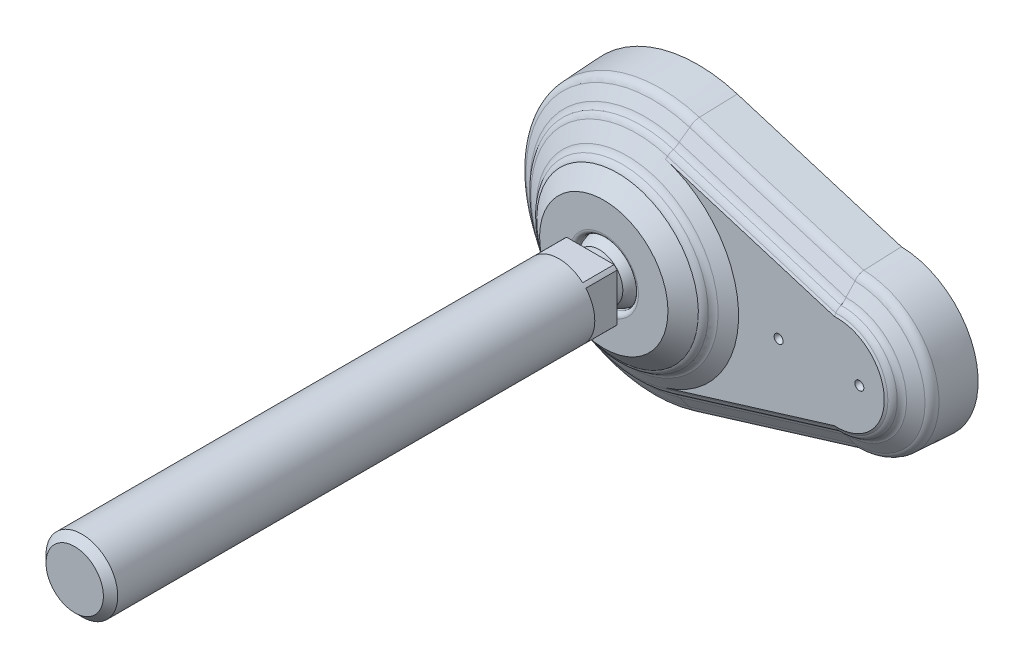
ISO-10303-21;
HEADER;
FILE_DESCRIPTION(('STEP AP214'),'2;1');
FILE_NAME('part.step','',(''),(''),'','','');
FILE_SCHEMA(('AUTOMOTIVE_DESIGN { 1 0 10303 214 1 1 1 1 }'));
ENDSEC;
DATA;
#1=APPLICATION_CONTEXT('core data for automotive mechanical design processes');
#2=APPLICATION_PROTOCOL_DEFINITION('international standard','automotive_design',2000,#1);
#3=PRODUCT_CONTEXT('',#1,'mechanical');
#4=PRODUCT('Part','Part','',(#3));
#5=PRODUCT_RELATED_PRODUCT_CATEGORY('part','',(#4));
#6=PRODUCT_DEFINITION_FORMATION('','',#4);
#7=PRODUCT_DEFINITION_CONTEXT('part definition',#1,'design');
#8=PRODUCT_DEFINITION('design','',#6,#7);
#9=PRODUCT_DEFINITION_SHAPE('','',#8);
#10=(LENGTH_UNIT() NAMED_UNIT(*) SI_UNIT(.MILLI.,.METRE.));
#11=(NAMED_UNIT(*) PLANE_ANGLE_UNIT() SI_UNIT($,.RADIAN.));
#12=(NAMED_UNIT(*) SI_UNIT($,.STERADIAN.) SOLID_ANGLE_UNIT());
#13=UNCERTAINTY_MEASURE_WITH_UNIT(LENGTH_MEASURE(1.E-05),#10,'distance_accuracy_value','');
#14=(GEOMETRIC_REPRESENTATION_CONTEXT(3) GLOBAL_UNCERTAINTY_ASSIGNED_CONTEXT((#13)) GLOBAL_UNIT_ASSIGNED_CONTEXT((#10,
#11,#12)) REPRESENTATION_CONTEXT('',''));
#15=CARTESIAN_POINT('',(0.,0.,0.));
#16=DIRECTION('',(0.,0.,1.));
#17=DIRECTION('',(1.,0.,0.));
#18=AXIS2_PLACEMENT_3D('',#15,#16,#17);
#19=CARTESIAN_POINT('',(0.,0.,31.));
#20=DIRECTION('',(0.,0.,1.));
#21=DIRECTION('',(-1.,0.,0.));
#22=AXIS2_PLACEMENT_3D('',#19,#20,#21);
#23=CYLINDRICAL_SURFACE('',#22,8.);
#24=CARTESIAN_POINT('',(0.,0.,137.4));
#25=DIRECTION('',(0.,0.,1.));
#26=DIRECTION('',(1.,0.,0.));
#27=AXIS2_PLACEMENT_3D('',#24,#25,#26);
#28=CIRCLE('',#27,8.);
#29=CARTESIAN_POINT('',(8.,0.,137.4));
#30=VERTEX_POINT('',#29);
#31=EDGE_CURVE('E9',#30,#30,#28,.F.);
#32=ORIENTED_EDGE('',*,*,#31,.T.);
#33=EDGE_LOOP('',(#32));
#34=FACE_BOUND('',#33,.T.);
#35=DIRECTION('',(0.,0.,1.));
#36=VECTOR('',#35,1.);
#37=CARTESIAN_POINT('',(6.,-5.29150262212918,31.));
#38=LINE('',#37,#36);
#39=CARTESIAN_POINT('',(6.,-5.29150262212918,31.));
#40=VERTEX_POINT('',#39);
#41=CARTESIAN_POINT('',(6.,-5.29150262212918,24.));
#42=VERTEX_POINT('',#41);
#43=EDGE_CURVE('E197',#40,#42,#38,.F.);
#44=ORIENTED_EDGE('',*,*,#43,.F.);
#45=CARTESIAN_POINT('',(0.,0.,31.));
#46=DIRECTION('',(0.,0.,1.));
#47=DIRECTION('',(1.,0.,0.));
#48=AXIS2_PLACEMENT_3D('',#45,#46,#47);
#49=CIRCLE('',#48,8.);
#50=CARTESIAN_POINT('',(6.,5.29150262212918,31.));
#51=VERTEX_POINT('',#50);
#52=EDGE_CURVE('E588',#40,#51,#49,.T.);
#53=ORIENTED_EDGE('',*,*,#52,.T.);
#54=DIRECTION('',(0.,0.,1.));
#55=VECTOR('',#54,1.);
#56=CARTESIAN_POINT('',(6.,5.29150262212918,31.));
#57=LINE('',#56,#55);
#58=CARTESIAN_POINT('',(6.,5.29150262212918,24.));
#59=VERTEX_POINT('',#58);
#60=EDGE_CURVE('E207',#59,#51,#57,.T.);
#61=ORIENTED_EDGE('',*,*,#60,.F.);
#62=CARTESIAN_POINT('',(0.,0.,24.));
#63=DIRECTION('',(0.,0.,1.));
#64=DIRECTION('',(-1.,0.,0.));
#65=AXIS2_PLACEMENT_3D('',#62,#63,#64);
#66=CIRCLE('',#65,8.);
#67=CARTESIAN_POINT('',(5.29150262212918,6.,24.));
#68=VERTEX_POINT('',#67);
#69=EDGE_CURVE('E180',#59,#68,#66,.T.);
#70=ORIENTED_EDGE('',*,*,#69,.T.);
#71=DIRECTION('',(0.,0.,1.));
#72=VECTOR('',#71,1.);
#73=CARTESIAN_POINT('',(5.29150262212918,6.,31.));
#74=LINE('',#73,#72);
#75=CARTESIAN_POINT('',(5.29150262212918,6.,31.));
#76=VERTEX_POINT('',#75);
#77=EDGE_CURVE('E161',#76,#68,#74,.F.);
#78=ORIENTED_EDGE('',*,*,#77,.F.);
#79=CARTESIAN_POINT('',(-5.29150262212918,6.,31.));
#80=VERTEX_POINT('',#79);
#81=EDGE_CURVE('E174',#76,#80,#49,.T.);
#82=ORIENTED_EDGE('',*,*,#81,.T.);
#83=DIRECTION('',(0.,0.,1.));
#84=VECTOR('',#83,1.);
#85=CARTESIAN_POINT('',(-5.29150262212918,6.,31.));
#86=LINE('',#85,#84);
#87=CARTESIAN_POINT('',(-5.29150262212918,6.,24.));
#88=VERTEX_POINT('',#87);
#89=EDGE_CURVE('E159',#88,#80,#86,.T.);
#90=ORIENTED_EDGE('',*,*,#89,.F.);
#91=CARTESIAN_POINT('',(-6.,5.29150262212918,24.));
#92=VERTEX_POINT('',#91);
#93=EDGE_CURVE('E172',#88,#92,#66,.T.);
#94=ORIENTED_EDGE('',*,*,#93,.T.);
#95=DIRECTION('',(0.,0.,1.));
#96=VECTOR('',#95,1.);
#97=CARTESIAN_POINT('',(-6.,5.29150262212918,31.));
#98=LINE('',#97,#96);
#99=CARTESIAN_POINT('',(-6.,5.29150262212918,31.));
#100=VERTEX_POINT('',#99);
#101=EDGE_CURVE('E175',#100,#92,#98,.F.);
#102=ORIENTED_EDGE('',*,*,#101,.F.);
#103=CARTESIAN_POINT('',(-6.,-5.29150262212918,31.));
#104=VERTEX_POINT('',#103);
#105=EDGE_CURVE('E598',#100,#104,#49,.T.);
#106=ORIENTED_EDGE('',*,*,#105,.T.);
#107=DIRECTION('',(0.,0.,1.));
#108=VECTOR('',#107,1.);
#109=CARTESIAN_POINT('',(-6.,-5.29150262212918,31.));
#110=LINE('',#109,#108);
#111=CARTESIAN_POINT('',(-6.,-5.29150262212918,24.));
#112=VERTEX_POINT('',#111);
#113=EDGE_CURVE('E181',#112,#104,#110,.T.);
#114=ORIENTED_EDGE('',*,*,#113,.F.);
#115=CARTESIAN_POINT('',(-5.29150262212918,-6.,24.));
#116=VERTEX_POINT('',#115);
#117=EDGE_CURVE('E183',#112,#116,#66,.T.);
#118=ORIENTED_EDGE('',*,*,#117,.T.);
#119=DIRECTION('',(0.,0.,1.));
#120=VECTOR('',#119,1.);
#121=CARTESIAN_POINT('',(-5.29150262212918,-6.,31.));
#122=LINE('',#121,#120);
#123=CARTESIAN_POINT('',(-5.29150262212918,-6.,31.));
#124=VERTEX_POINT('',#123);
#125=EDGE_CURVE('E136',#124,#116,#122,.F.);
#126=ORIENTED_EDGE('',*,*,#125,.F.);
#127=CARTESIAN_POINT('',(5.29150262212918,-6.,31.));
#128=VERTEX_POINT('',#127);
#129=EDGE_CURVE('E597',#124,#128,#49,.T.);
#130=ORIENTED_EDGE('',*,*,#129,.T.);
#131=DIRECTION('',(0.,0.,1.));
#132=VECTOR('',#131,1.);
#133=CARTESIAN_POINT('',(5.29150262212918,-6.,31.));
#134=LINE('',#133,#132);
#135=CARTESIAN_POINT('',(5.29150262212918,-6.,24.));
#136=VERTEX_POINT('',#135);
#137=EDGE_CURVE('E200',#136,#128,#134,.T.);
#138=ORIENTED_EDGE('',*,*,#137,.F.);
#139=EDGE_CURVE('E184',#136,#42,#66,.T.);
#140=ORIENTED_EDGE('',*,*,#139,.T.);
#141=EDGE_LOOP('',(#44,#53,#61,#70,#78,#82,#90,#94,#102,#106,#114,#118,#126,#130,#138,#140));
#142=FACE_BOUND('',#141,.T.);
#143=ADVANCED_FACE('F14',(#34,#142),#23,.T.);
#144=CARTESIAN_POINT('',(-5.24903501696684,0.,24.));
#145=DIRECTION('',(0.,0.,1.));
#146=DIRECTION('',(-1.,0.,0.));
#147=AXIS2_PLACEMENT_3D('',#144,#145,#146);
#148=PLANE('',#147);
#149=DIRECTION('',(0.,-1.,0.));
#150=VECTOR('',#149,1.);
#151=CARTESIAN_POINT('',(-6.,0.,24.));
#152=LINE('',#151,#150);
#153=EDGE_CURVE('E31',#92,#112,#152,.T.);
#154=ORIENTED_EDGE('',*,*,#153,.F.);
#155=ORIENTED_EDGE('',*,*,#93,.F.);
#156=DIRECTION('',(-1.,0.,0.));
#157=VECTOR('',#156,1.);
#158=CARTESIAN_POINT('',(-5.24903501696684,6.,24.));
#159=LINE('',#158,#157);
#160=EDGE_CURVE('E154',#68,#88,#159,.T.);
#161=ORIENTED_EDGE('',*,*,#160,.F.);
#162=ORIENTED_EDGE('',*,*,#69,.F.);
#163=DIRECTION('',(0.,1.,0.));
#164=VECTOR('',#163,1.);
#165=CARTESIAN_POINT('',(6.,0.,24.));
#166=LINE('',#165,#164);
#167=EDGE_CURVE('E203',#42,#59,#166,.T.);
#168=ORIENTED_EDGE('',*,*,#167,.F.);
#169=ORIENTED_EDGE('',*,*,#139,.F.);
#170=DIRECTION('',(1.,0.,0.));
#171=VECTOR('',#170,1.);
#172=CARTESIAN_POINT('',(-5.24903501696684,-6.,24.));
#173=LINE('',#172,#171);
#174=EDGE_CURVE('E202',#116,#136,#173,.T.);
#175=ORIENTED_EDGE('',*,*,#174,.F.);
#176=ORIENTED_EDGE('',*,*,#117,.F.);
#177=EDGE_LOOP('',(#154,#155,#161,#162,#168,#169,#175,#176));
#178=FACE_BOUND('',#177,.T.);
#179=CARTESIAN_POINT('',(0.,0.,24.));
#180=DIRECTION('',(0.,0.,1.));
#181=DIRECTION('',(-1.,0.,0.));
#182=AXIS2_PLACEMENT_3D('',#179,#180,#181);
#183=CIRCLE('',#182,5.24903501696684);
#184=CARTESIAN_POINT('',(-5.24903501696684,0.,24.));
#185=VERTEX_POINT('',#184);
#186=EDGE_CURVE('E189',#185,#185,#183,.T.);
#187=ORIENTED_EDGE('',*,*,#186,.T.);
#188=EDGE_LOOP('',(#187));
#189=FACE_BOUND('',#188,.T.);
#190=ADVANCED_FACE('F177',(#178,#189),#148,.F.);
#191=CARTESIAN_POINT('',(0.,0.,17.6309999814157));
#192=DIRECTION('',(0.,0.,1.));
#193=DIRECTION('',(-1.,0.,0.));
#194=AXIS2_PLACEMENT_3D('',#191,#192,#193);
#195=DEGENERATE_TOROIDAL_SURFACE('',#194,0.0005038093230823,6.829,.T.);
#196=CARTESIAN_POINT('',(0.,0.,18.775));
#197=DIRECTION('',(0.,0.,-1.));
#198=DIRECTION('',(1.,0.,0.));
#199=AXIS2_PLACEMENT_3D('',#196,#197,#198);
#200=CIRCLE('',#199,6.733);
#201=CARTESIAN_POINT('',(6.733,0.,18.775));
#202=VERTEX_POINT('',#201);
#203=EDGE_CURVE('E224',#202,#202,#200,.T.);
#204=ORIENTED_EDGE('',*,*,#203,.F.);
#205=EDGE_LOOP('',(#204));
#206=FACE_BOUND('',#205,.T.);
#207=CARTESIAN_POINT('',(0.,0.,22.));
#208=DIRECTION('',(0.,0.,1.));
#209=DIRECTION('',(-1.,0.,0.));
#210=AXIS2_PLACEMENT_3D('',#207,#208,#209);
#211=CIRCLE('',#210,5.24903501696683);
#212=CARTESIAN_POINT('',(-5.24903501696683,0.,22.));
#213=VERTEX_POINT('',#212);
#214=EDGE_CURVE('E191',#213,#213,#211,.T.);
#215=ORIENTED_EDGE('',*,*,#214,.F.);
#216=EDGE_LOOP('',(#215));
#217=FACE_BOUND('',#216,.T.);
#218=ADVANCED_FACE('F447',(#206,#217),#195,.T.);
#219=CARTESIAN_POINT('',(0.,0.,31.));
#220=DIRECTION('',(0.,0.,1.));
#221=DIRECTION('',(-1.,0.,0.));
#222=AXIS2_PLACEMENT_3D('',#219,#220,#221);
#223=CYLINDRICAL_SURFACE('',#222,5.24903501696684);
#224=ORIENTED_EDGE('',*,*,#186,.F.);
#225=EDGE_LOOP('',(#224));
#226=FACE_BOUND('',#225,.T.);
#227=ORIENTED_EDGE('',*,*,#214,.T.);
#228=EDGE_LOOP('',(#227));
#229=FACE_BOUND('',#228,.T.);
#230=ADVANCED_FACE('F549',(#226,#229),#223,.T.);
#231=CARTESIAN_POINT('',(-6.,-6.,23.));
#232=DIRECTION('',(0.,-1.,0.));
#233=DIRECTION('',(1.,0.,0.));
#234=AXIS2_PLACEMENT_3D('',#231,#232,#233);
#235=PLANE('',#234);
#236=ORIENTED_EDGE('',*,*,#137,.T.);
#237=DIRECTION('',(-1.,0.,0.));
#238=VECTOR('',#237,1.);
#239=CARTESIAN_POINT('',(-8.,-6.,31.));
#240=LINE('',#239,#238);
#241=EDGE_CURVE('E556',#128,#124,#240,.T.);
#242=ORIENTED_EDGE('',*,*,#241,.T.);
#243=ORIENTED_EDGE('',*,*,#125,.T.);
#244=ORIENTED_EDGE('',*,*,#174,.T.);
#245=EDGE_LOOP('',(#236,#242,#243,#244));
#246=FACE_BOUND('',#245,.T.);
#247=ADVANCED_FACE('F547',(#246),#235,.T.);
#248=CARTESIAN_POINT('',(6.,-6.,23.));
#249=DIRECTION('',(1.,0.,0.));
#250=DIRECTION('',(0.,1.,0.));
#251=AXIS2_PLACEMENT_3D('',#248,#249,#250);
#252=PLANE('',#251);
#253=ORIENTED_EDGE('',*,*,#60,.T.);
#254=DIRECTION('',(0.,-1.,0.));
#255=VECTOR('',#254,1.);
#256=CARTESIAN_POINT('',(6.,0.,31.));
#257=LINE('',#256,#255);
#258=EDGE_CURVE('E566',#51,#40,#257,.T.);
#259=ORIENTED_EDGE('',*,*,#258,.T.);
#260=ORIENTED_EDGE('',*,*,#43,.T.);
#261=ORIENTED_EDGE('',*,*,#167,.T.);
#262=EDGE_LOOP('',(#253,#259,#260,#261));
#263=FACE_BOUND('',#262,.T.);
#264=ADVANCED_FACE('F543',(#263),#252,.T.);
#265=CARTESIAN_POINT('',(6.,6.,23.));
#266=DIRECTION('',(0.,1.,0.));
#267=DIRECTION('',(-1.,0.,0.));
#268=AXIS2_PLACEMENT_3D('',#265,#266,#267);
#269=PLANE('',#268);
#270=ORIENTED_EDGE('',*,*,#89,.T.);
#271=DIRECTION('',(1.,0.,0.));
#272=VECTOR('',#271,1.);
#273=CARTESIAN_POINT('',(-8.,6.,31.));
#274=LINE('',#273,#272);
#275=EDGE_CURVE('E231',#80,#76,#274,.T.);
#276=ORIENTED_EDGE('',*,*,#275,.T.);
#277=ORIENTED_EDGE('',*,*,#77,.T.);
#278=ORIENTED_EDGE('',*,*,#160,.T.);
#279=EDGE_LOOP('',(#270,#276,#277,#278));
#280=FACE_BOUND('',#279,.T.);
#281=ADVANCED_FACE('F156',(#280),#269,.T.);
#282=CARTESIAN_POINT('',(-6.,6.,23.));
#283=DIRECTION('',(-1.,0.,0.));
#284=DIRECTION('',(0.,-1.,0.));
#285=AXIS2_PLACEMENT_3D('',#282,#283,#284);
#286=PLANE('',#285);
#287=ORIENTED_EDGE('',*,*,#113,.T.);
#288=DIRECTION('',(0.,1.,0.));
#289=VECTOR('',#288,1.);
#290=CARTESIAN_POINT('',(-6.,0.,31.));
#291=LINE('',#290,#289);
#292=EDGE_CURVE('E217',#104,#100,#291,.T.);
#293=ORIENTED_EDGE('',*,*,#292,.T.);
#294=ORIENTED_EDGE('',*,*,#101,.T.);
#295=ORIENTED_EDGE('',*,*,#153,.T.);
#296=EDGE_LOOP('',(#287,#293,#294,#295));
#297=FACE_BOUND('',#296,.T.);
#298=ADVANCED_FACE('F457',(#297),#286,.T.);
#299=CARTESIAN_POINT('',(45.,0.,0.));
#300=DIRECTION('',(0.,0.,-1.));
#301=DIRECTION('',(0.,1.,0.));
#302=AXIS2_PLACEMENT_3D('',#299,#300,#301);
#303=CONICAL_SURFACE('',#302,17.5,0.0523365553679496);
#304=CARTESIAN_POINT('',(45.,0.,8.304));
#305=DIRECTION('',(0.,0.,1.));
#306=DIRECTION('',(0.,-1.,0.));
#307=AXIS2_PLACEMENT_3D('',#304,#305,#306);
#308=CIRCLE('',#307,17.065);
#309=CARTESIAN_POINT('',(45.3136024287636,-17.0621182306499,8.304));
#310=VERTEX_POINT('',#309);
#311=CARTESIAN_POINT('',(45.3136024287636,17.0621182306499,8.304));
#312=VERTEX_POINT('',#311);
#313=EDGE_CURVE('E276',#310,#312,#308,.T.);
#314=ORIENTED_EDGE('',*,*,#313,.F.);
#315=CARTESIAN_POINT('',(45.3136007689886,-17.0621077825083,8.3042));
#316=CARTESIAN_POINT('',(45.3250873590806,-17.134412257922,6.92013380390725));
#317=CARTESIAN_POINT('',(45.3366049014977,-17.206707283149,5.5360673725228));
#318=CARTESIAN_POINT('',(45.3597018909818,-17.3512784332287,2.76793403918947));
#319=CARTESIAN_POINT('',(45.3712813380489,-17.4235545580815,1.38386713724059));
#320=CARTESIAN_POINT('',(45.3828917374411,-17.4958212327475,-0.00020000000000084));
#321=B_SPLINE_CURVE_WITH_KNOTS('',3,(#315,#316,#317,#318,#319,#320),.UNSPECIFIED.,.F.,.F.,(4,2,
4),(0.,4.15800336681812,8.31600673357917),.UNSPECIFIED.);
#322=CARTESIAN_POINT('',(45.3828900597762,-17.4958107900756,0.));
#323=VERTEX_POINT('',#322);
#324=EDGE_CURVE('E967',#310,#323,#321,.T.);
#325=ORIENTED_EDGE('',*,*,#324,.T.);
#326=CARTESIAN_POINT('',(45.,0.,0.));
#327=DIRECTION('',(0.,0.,1.));
#328=DIRECTION('',(0.,-1.,0.));
#329=AXIS2_PLACEMENT_3D('',#326,#327,#328);
#330=CIRCLE('',#329,17.5);
#331=CARTESIAN_POINT('',(45.3828900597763,17.4958107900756,0.));
#332=VERTEX_POINT('',#331);
#333=EDGE_CURVE('E279',#323,#332,#330,.T.);
#334=ORIENTED_EDGE('',*,*,#333,.T.);
#335=CARTESIAN_POINT('',(45.3828917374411,17.4958212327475,-0.0002));
#336=CARTESIAN_POINT('',(45.371281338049,17.4235545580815,1.38386713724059));
#337=CARTESIAN_POINT('',(45.359701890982,17.3512784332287,2.76793403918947));
#338=CARTESIAN_POINT('',(45.3366049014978,17.206707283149,5.5360673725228));
#339=CARTESIAN_POINT('',(45.3250873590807,17.134412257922,6.92013380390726));
#340=CARTESIAN_POINT('',(45.3136007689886,17.0621077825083,8.3042));
#341=B_SPLINE_CURVE_WITH_KNOTS('',3,(#335,#336,#337,#338,#339,#340),.UNSPECIFIED.,.F.,.F.,(4,2,
4),(0.,4.15800336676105,8.31600673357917),.UNSPECIFIED.);
#342=EDGE_CURVE('E1045',#332,#312,#341,.T.);
#343=ORIENTED_EDGE('',*,*,#342,.T.);
#344=EDGE_LOOP('',(#314,#325,#334,#343));
#345=FACE_BOUND('',#344,.T.);
#346=ADVANCED_FACE('F337',(#345),#303,.T.);
#347=CARTESIAN_POINT('',(46.8961596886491,-16.5782819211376,8.304));
#348=DIRECTION('',(-0.291971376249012,0.9549953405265,-0.0523126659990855));
#349=DIRECTION('',(-0.956304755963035,-0.292371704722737,0.));
#350=AXIS2_PLACEMENT_3D('',#347,#348,#349);
#351=PLANE('',#350);
#352=ORIENTED_EDGE('',*,*,#324,.F.);
#353=DIRECTION('',(-0.956304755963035,-0.292371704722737,0.));
#354=VECTOR('',#353,1.);
#355=CARTESIAN_POINT('',(46.8961596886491,-16.5782819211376,8.304));
#356=LINE('',#355,#354);
#357=CARTESIAN_POINT('',(8.64396945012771,-28.2731501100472,8.304));
#358=VERTEX_POINT('',#357);
#359=EDGE_CURVE('E1003',#310,#358,#356,.T.);
#360=ORIENTED_EDGE('',*,*,#359,.T.);
#361=DIRECTION('',(-0.0152947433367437,0.050026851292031,0.998630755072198));
#362=VECTOR('',#361,1.);
#363=CARTESIAN_POINT('',(8.7711511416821,-28.689142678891,0.));
#364=LINE('',#363,#362);
#365=CARTESIAN_POINT('',(8.7711511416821,-28.689142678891,0.));
#366=VERTEX_POINT('',#365);
#367=EDGE_CURVE('E998',#366,#358,#364,.T.);
#368=ORIENTED_EDGE('',*,*,#367,.F.);
#369=DIRECTION('',(-0.956304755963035,-0.292371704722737,0.));
#370=VECTOR('',#369,1.);
#371=CARTESIAN_POINT('',(47.0233413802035,-16.9942744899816,0.));
#372=LINE('',#371,#370);
#373=EDGE_CURVE('E127',#323,#366,#372,.T.);
#374=ORIENTED_EDGE('',*,*,#373,.F.);
#375=EDGE_LOOP('',(#352,#360,#368,#374));
#376=FACE_BOUND('',#375,.T.);
#377=ADVANCED_FACE('F443',(#376),#351,.F.);
#378=CARTESIAN_POINT('',(0.,0.,0.));
#379=DIRECTION('',(0.,0.,1.));
#380=DIRECTION('',(0.,-1.,0.));
#381=AXIS2_PLACEMENT_3D('',#378,#379,#380);
#382=PLANE('',#381);
#383=DIRECTION('',(-0.956304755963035,0.292371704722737,0.));
#384=VECTOR('',#383,1.);
#385=CARTESIAN_POINT('',(47.0233413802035,16.9942744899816,0.));
#386=LINE('',#385,#384);
#387=CARTESIAN_POINT('',(8.7711511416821,28.689142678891,0.));
#388=VERTEX_POINT('',#387);
#389=EDGE_CURVE('E1044',#332,#388,#386,.T.);
#390=ORIENTED_EDGE('',*,*,#389,.F.);
#391=ORIENTED_EDGE('',*,*,#333,.F.);
#392=ORIENTED_EDGE('',*,*,#373,.T.);
#393=CARTESIAN_POINT('',(0.,0.,0.));
#394=DIRECTION('',(0.,0.,1.));
#395=DIRECTION('',(0.,-1.,0.));
#396=AXIS2_PLACEMENT_3D('',#393,#394,#395);
#397=CIRCLE('',#396,30.);
#398=EDGE_CURVE('E325',#388,#366,#397,.T.);
#399=ORIENTED_EDGE('',*,*,#398,.F.);
#400=EDGE_LOOP('',(#390,#391,#392,#399));
#401=FACE_BOUND('',#400,.T.);
#402=CARTESIAN_POINT('',(32.,0.,0.));
#403=DIRECTION('',(0.,0.,-1.));
#404=DIRECTION('',(-1.,0.,0.));
#405=AXIS2_PLACEMENT_3D('',#402,#403,#404);
#406=CIRCLE('',#405,4.25);
#407=CARTESIAN_POINT('',(27.75,0.,0.));
#408=VERTEX_POINT('',#407);
#409=EDGE_CURVE('E602',#408,#408,#406,.T.);
#410=ORIENTED_EDGE('',*,*,#409,.F.);
#411=EDGE_LOOP('',(#410));
#412=FACE_BOUND('',#411,.T.);
#413=CARTESIAN_POINT('',(50.,0.,0.));
#414=DIRECTION('',(0.,0.,-1.));
#415=DIRECTION('',(-1.,0.,0.));
#416=AXIS2_PLACEMENT_3D('',#413,#414,#415);
#417=CIRCLE('',#416,4.25);
#418=CARTESIAN_POINT('',(45.75,0.,0.));
#419=VERTEX_POINT('',#418);
#420=EDGE_CURVE('E612',#419,#419,#417,.T.);
#421=ORIENTED_EDGE('',*,*,#420,.F.);
#422=EDGE_LOOP('',(#421));
#423=FACE_BOUND('',#422,.T.);
#424=ADVANCED_FACE('F335',(#401,#412,#423),#382,.F.);
#425=CARTESIAN_POINT('',(47.0233413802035,16.9942744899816,0.));
#426=DIRECTION('',(-0.291971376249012,-0.9549953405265,-0.0523126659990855));
#427=DIRECTION('',(0.956304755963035,-0.292371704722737,0.));
#428=AXIS2_PLACEMENT_3D('',#425,#426,#427);
#429=PLANE('',#428);
#430=ORIENTED_EDGE('',*,*,#342,.F.);
#431=ORIENTED_EDGE('',*,*,#389,.T.);
#432=DIRECTION('',(-0.0152947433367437,-0.050026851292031,0.998630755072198));
#433=VECTOR('',#432,1.);
#434=CARTESIAN_POINT('',(8.7711511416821,28.689142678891,0.));
#435=LINE('',#434,#433);
#436=CARTESIAN_POINT('',(8.64396945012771,28.2731501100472,8.304));
#437=VERTEX_POINT('',#436);
#438=EDGE_CURVE('E1000',#388,#437,#435,.T.);
#439=ORIENTED_EDGE('',*,*,#438,.T.);
#440=DIRECTION('',(-0.956304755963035,0.292371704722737,0.));
#441=VECTOR('',#440,1.);
#442=CARTESIAN_POINT('',(46.8961596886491,16.5782819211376,8.304));
#443=LINE('',#442,#441);
#444=EDGE_CURVE('E1042',#312,#437,#443,.T.);
#445=ORIENTED_EDGE('',*,*,#444,.F.);
#446=EDGE_LOOP('',(#430,#431,#439,#445));
#447=FACE_BOUND('',#446,.T.);
#448=ADVANCED_FACE('F413',(#447),#429,.F.);
#449=CARTESIAN_POINT('',(45.,0.,8.20868962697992));
#450=DIRECTION('',(0.,0.,1.));
#451=DIRECTION('',(0.,-1.,0.));
#452=AXIS2_PLACEMENT_3D('',#449,#450,#451);
#453=TOROIDAL_SURFACE('',#452,15.0672723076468,2.);
#454=CARTESIAN_POINT('',(45.313603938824,-17.062127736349,8.3038));
#455=CARTESIAN_POINT('',(45.3131828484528,-17.0594763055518,8.3596419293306));
#456=CARTESIAN_POINT('',(45.3123906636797,-17.0544900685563,8.41534315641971));
#457=CARTESIAN_POINT('',(45.3100724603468,-17.0398916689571,8.52611669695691));
#458=CARTESIAN_POINT('',(45.3085464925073,-17.0302798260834,8.5811890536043));
#459=CARTESIAN_POINT('',(45.3028875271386,-16.9946160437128,8.7447437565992));
#460=CARTESIAN_POINT('',(45.2976717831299,-16.9617253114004,8.85178061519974));
#461=CARTESIAN_POINT('',(45.284530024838,-16.8786837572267,9.05872519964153));
#462=CARTESIAN_POINT('',(45.2766032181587,-16.8285278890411,9.1586308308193));
#463=CARTESIAN_POINT('',(45.2583029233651,-16.7124179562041,9.34857034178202));
#464=CARTESIAN_POINT('',(45.24792931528,-16.6464631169,9.43860373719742));
#465=CARTESIAN_POINT('',(45.2250216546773,-16.5003240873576,9.60671335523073));
#466=CARTESIAN_POINT('',(45.2124772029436,-16.4200713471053,9.68472843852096));
#467=CARTESIAN_POINT('',(45.1856662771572,-16.2478592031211,9.8261370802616));
#468=CARTESIAN_POINT('',(45.1714009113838,-16.1559073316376,9.88953997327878));
#469=CARTESIAN_POINT('',(45.148748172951,-16.0092275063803,9.97356807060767));
#470=CARTESIAN_POINT('',(45.1408156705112,-15.957749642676,10.0001426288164));
#471=CARTESIAN_POINT('',(45.1246863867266,-15.8528232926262,10.0486569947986));
#472=CARTESIAN_POINT('',(45.1164901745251,-15.7993790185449,10.0706061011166));
#473=CARTESIAN_POINT('',(45.1081834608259,-15.7450737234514,10.0902));
#474=B_SPLINE_CURVE_WITH_KNOTS('',3,(#454,#455,#456,#457,#458,#459,#460,#461,#462,#463,#464,
#465,#466,#467,#468,#469,#470,#471,#472,#473),.UNSPECIFIED.,.F.,.F.,(4,2,2,2,2,2,2,2,2,4),(0.,
0.167615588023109,0.335219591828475,0.669784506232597,1.00444729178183,1.33912648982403,
1.67545571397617,2.01156948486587,2.1867983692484,2.36167155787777),.UNSPECIFIED.);
#475=CARTESIAN_POINT('',(45.108268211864,-15.7456277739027,10.09));
#476=VERTEX_POINT('',#475);
#477=EDGE_CURVE('E1081',#310,#476,#474,.T.);
#478=ORIENTED_EDGE('',*,*,#477,.F.);
#479=ORIENTED_EDGE('',*,*,#313,.T.);
#480=CARTESIAN_POINT('',(45.1081834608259,15.7450737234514,10.0902));
#481=CARTESIAN_POINT('',(45.1162755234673,15.7979756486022,10.0711117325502));
#482=CARTESIAN_POINT('',(45.1242625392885,15.8500594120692,10.0497900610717));
#483=CARTESIAN_POINT('',(45.1399729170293,15.9522733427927,10.0028085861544));
#484=CARTESIAN_POINT('',(45.1476962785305,16.0024035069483,9.97714877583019));
#485=CARTESIAN_POINT('',(45.170371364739,16.1492634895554,9.89392549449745));
#486=CARTESIAN_POINT('',(45.1848488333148,16.2425982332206,9.83006921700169));
#487=CARTESIAN_POINT('',(45.2120467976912,16.4173167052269,9.6873614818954));
#488=CARTESIAN_POINT('',(45.2247661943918,16.4986929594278,9.60850071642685));
#489=CARTESIAN_POINT('',(45.2480269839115,16.647087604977,9.4379734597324));
#490=CARTESIAN_POINT('',(45.2585686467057,16.7141077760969,9.34630855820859));
#491=CARTESIAN_POINT('',(45.2770522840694,16.8313730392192,9.15345563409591));
#492=CARTESIAN_POINT('',(45.2850114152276,16.8817288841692,9.05233645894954));
#493=CARTESIAN_POINT('',(45.298151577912,16.9647535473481,8.84294631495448));
#494=CARTESIAN_POINT('',(45.3033350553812,16.9974379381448,8.73468173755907));
#495=CARTESIAN_POINT('',(45.3088197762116,17.0320013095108,8.57167924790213));
#496=CARTESIAN_POINT('',(45.3102579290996,17.0410597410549,8.51840996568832));
#497=CARTESIAN_POINT('',(45.3124461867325,17.0548396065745,8.41140374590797));
#498=CARTESIAN_POINT('',(45.3131976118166,17.0595693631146,8.35766790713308));
#499=CARTESIAN_POINT('',(45.313603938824,17.062127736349,8.3038));
#500=B_SPLINE_CURVE_WITH_KNOTS('',3,(#480,#481,#482,#483,#484,#485,#486,#487,#488,#489,#490,
#491,#492,#493,#494,#495,#496,#497,#498,#499),.UNSPECIFIED.,.F.,.F.,(4,2,2,2,2,2,2,2,2,4),(0.,
0.170355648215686,0.340711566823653,0.680992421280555,1.02148505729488,1.36193545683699,
1.70007548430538,2.03791704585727,2.19992239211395,2.36161559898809),.UNSPECIFIED.);
#501=CARTESIAN_POINT('',(45.1082682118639,15.7456277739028,10.09));
#502=VERTEX_POINT('',#501);
#503=EDGE_CURVE('E402',#502,#312,#500,.T.);
#504=ORIENTED_EDGE('',*,*,#503,.F.);
#505=CARTESIAN_POINT('',(45.,0.,10.09));
#506=DIRECTION('',(0.,0.,1.));
#507=DIRECTION('',(0.,-1.,0.));
#508=AXIS2_PLACEMENT_3D('',#505,#506,#507);
#509=CIRCLE('',#508,15.746);
#510=EDGE_CURVE('E273',#476,#502,#509,.T.);
#511=ORIENTED_EDGE('',*,*,#510,.F.);
#512=EDGE_LOOP('',(#478,#479,#504,#511));
#513=FACE_BOUND('',#512,.T.);
#514=ADVANCED_FACE('F386',(#513),#453,.T.);
#515=CARTESIAN_POINT('',(46.312080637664,-14.6678454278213,8.20868962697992));
#516=DIRECTION('',(-0.956304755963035,-0.292371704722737,0.));
#517=DIRECTION('',(0.292371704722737,-0.956304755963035,0.));
#518=AXIS2_PLACEMENT_3D('',#515,#516,#517);
#519=CYLINDRICAL_SURFACE('',#518,2.);
#520=ORIENTED_EDGE('',*,*,#359,.F.);
#521=ORIENTED_EDGE('',*,*,#477,.T.);
#522=DIRECTION('',(-0.956304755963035,-0.292371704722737,0.));
#523=VECTOR('',#522,1.);
#524=CARTESIAN_POINT('',(46.5105214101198,-15.3169159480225,10.09));
#525=LINE('',#524,#523);
#526=CARTESIAN_POINT('',(8.25833117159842,-27.0117841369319,10.09));
#527=VERTEX_POINT('',#526);
#528=EDGE_CURVE('E1048',#476,#527,#525,.T.);
#529=ORIENTED_EDGE('',*,*,#528,.T.);
#530=CARTESIAN_POINT('',(8.05989039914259,-26.3627136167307,8.20868962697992));
#531=DIRECTION('',(0.956304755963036,0.292371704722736,0.));
#532=DIRECTION('',(-0.292371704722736,0.956304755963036,0.));
#533=AXIS2_PLACEMENT_3D('',#530,#531,#532);
#534=CIRCLE('',#533,2.);
#535=EDGE_CURVE('E1004',#527,#358,#534,.T.);
#536=ORIENTED_EDGE('',*,*,#535,.T.);
#537=EDGE_LOOP('',(#520,#521,#529,#536));
#538=FACE_BOUND('',#537,.T.);
#539=ADVANCED_FACE('F414',(#538),#519,.T.);
#540=CARTESIAN_POINT('',(0.,0.,0.));
#541=DIRECTION('',(0.,0.,-1.));
#542=DIRECTION('',(0.,1.,0.));
#543=AXIS2_PLACEMENT_3D('',#540,#541,#542);
#544=CONICAL_SURFACE('',#543,30.,0.0523365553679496);
#545=CARTESIAN_POINT('',(0.,0.,8.304));
#546=DIRECTION('',(0.,0.,1.));
#547=DIRECTION('',(0.,-1.,0.));
#548=AXIS2_PLACEMENT_3D('',#545,#546,#547);
#549=CIRCLE('',#548,29.565);
#550=EDGE_CURVE('E988',#437,#358,#549,.T.);
#551=ORIENTED_EDGE('',*,*,#550,.F.);
#552=ORIENTED_EDGE('',*,*,#438,.F.);
#553=ORIENTED_EDGE('',*,*,#398,.T.);
#554=ORIENTED_EDGE('',*,*,#367,.T.);
#555=EDGE_LOOP('',(#551,#552,#553,#554));
#556=FACE_BOUND('',#555,.T.);
#557=ADVANCED_FACE('F434',(#556),#544,.T.);
#558=CARTESIAN_POINT('',(46.312080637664,14.6678454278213,8.20868962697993));
#559=DIRECTION('',(-0.956304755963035,0.292371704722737,0.));
#560=DIRECTION('',(-0.292371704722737,-0.956304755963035,0.));
#561=AXIS2_PLACEMENT_3D('',#558,#559,#560);
#562=CYLINDRICAL_SURFACE('',#561,2.);
#563=DIRECTION('',(-0.956304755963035,0.292371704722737,0.));
#564=VECTOR('',#563,1.);
#565=CARTESIAN_POINT('',(46.5105214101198,15.3169159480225,10.09));
#566=LINE('',#565,#564);
#567=CARTESIAN_POINT('',(8.25833117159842,27.0117841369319,10.09));
#568=VERTEX_POINT('',#567);
#569=EDGE_CURVE('E1037',#502,#568,#566,.T.);
#570=ORIENTED_EDGE('',*,*,#569,.F.);
#571=ORIENTED_EDGE('',*,*,#503,.T.);
#572=ORIENTED_EDGE('',*,*,#444,.T.);
#573=CARTESIAN_POINT('',(8.05989039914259,26.3627136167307,8.20868962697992));
#574=DIRECTION('',(-0.956304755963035,0.292371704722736,0.));
#575=DIRECTION('',(-0.292371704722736,-0.956304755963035,0.));
#576=AXIS2_PLACEMENT_3D('',#573,#574,#575);
#577=CIRCLE('',#576,2.);
#578=EDGE_CURVE('E1021',#568,#437,#577,.T.);
#579=ORIENTED_EDGE('',*,*,#578,.F.);
#580=EDGE_LOOP('',(#570,#571,#572,#579));
#581=FACE_BOUND('',#580,.T.);
#582=ADVANCED_FACE('F345',(#581),#562,.T.);
#583=CARTESIAN_POINT('',(45.,0.,10.09));
#584=DIRECTION('',(0.,0.,-1.));
#585=DIRECTION('',(0.,1.,0.));
#586=AXIS2_PLACEMENT_3D('',#583,#584,#585);
#587=CONICAL_SURFACE('',#586,15.746,0.993858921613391);
#588=CARTESIAN_POINT('',(45.,0.,11.7170000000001));
#589=DIRECTION('',(0.,0.,1.));
#590=DIRECTION('',(0.,-1.,0.));
#591=AXIS2_PLACEMENT_3D('',#588,#589,#590);
#592=CIRCLE('',#591,13.2459999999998);
#593=CARTESIAN_POINT('',(44.7416637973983,-13.243480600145,11.7170000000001));
#594=VERTEX_POINT('',#593);
#595=CARTESIAN_POINT('',(44.7416637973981,13.2434806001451,11.7170000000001));
#596=VERTEX_POINT('',#595);
#597=EDGE_CURVE('E271',#594,#596,#592,.T.);
#598=ORIENTED_EDGE('',*,*,#597,.F.);
#599=CARTESIAN_POINT('',(44.7416208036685,-13.2431723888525,11.7172000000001));
#600=CARTESIAN_POINT('',(44.8000092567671,-13.66082442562,11.4461588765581));
#601=CARTESIAN_POINT('',(44.8597613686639,-14.078214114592,11.1750215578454));
#602=CARTESIAN_POINT('',(44.9819928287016,-14.9124682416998,10.6325548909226));
#603=CARTESIAN_POINT('',(45.0444721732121,-15.3293326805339,10.3612255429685));
#604=CARTESIAN_POINT('',(45.1083151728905,-15.745934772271,10.0898));
#605=B_SPLINE_CURVE_WITH_KNOTS('',3,(#599,#600,#601,#602,#603,#604),.UNSPECIFIED.,.F.,.F.,(4,2,
4),(0.,1.50389468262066,3.0077873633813),.UNSPECIFIED.);
#606=EDGE_CURVE('E395',#594,#476,#605,.T.);
#607=ORIENTED_EDGE('',*,*,#606,.T.);
#608=ORIENTED_EDGE('',*,*,#510,.T.);
#609=CARTESIAN_POINT('',(45.1083151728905,15.745934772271,10.0898));
#610=CARTESIAN_POINT('',(45.0444721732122,15.3293326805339,10.3612255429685));
#611=CARTESIAN_POINT('',(44.9819928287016,14.9124682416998,10.6325548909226));
#612=CARTESIAN_POINT('',(44.8597613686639,14.078214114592,11.1750215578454));
#613=CARTESIAN_POINT('',(44.8000092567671,13.66082442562,11.4461588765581));
#614=CARTESIAN_POINT('',(44.7416208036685,13.2431723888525,11.7172000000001));
#615=B_SPLINE_CURVE_WITH_KNOTS('',3,(#609,#610,#611,#612,#613,#614),.UNSPECIFIED.,.F.,.F.,(4,2,
4),(0.,1.50389268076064,3.0077873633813),.UNSPECIFIED.);
#616=EDGE_CURVE('E389',#502,#596,#615,.T.);
#617=ORIENTED_EDGE('',*,*,#616,.T.);
#618=EDGE_LOOP('',(#598,#607,#608,#617));
#619=FACE_BOUND('',#618,.T.);
#620=ADVANCED_FACE('F380',(#619),#587,.T.);
#621=CARTESIAN_POINT('',(45.7795921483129,-12.9261540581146,11.7170000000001));
#622=DIRECTION('',(-0.159476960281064,0.521625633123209,-0.838137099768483));
#623=DIRECTION('',(0.,0.849002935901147,0.528388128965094));
#624=AXIS2_PLACEMENT_3D('',#621,#622,#623);
#625=PLANE('',#624);
#626=ORIENTED_EDGE('',*,*,#606,.F.);
#627=DIRECTION('',(-0.956304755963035,-0.292371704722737,0.));
#628=VECTOR('',#627,1.);
#629=CARTESIAN_POINT('',(45.7795921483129,-12.9261540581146,11.7170000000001));
#630=LINE('',#629,#628);
#631=CARTESIAN_POINT('',(7.52740190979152,-24.6210222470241,11.7170000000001));
#632=VERTEX_POINT('',#631);
#633=EDGE_CURVE('E1054',#594,#632,#630,.T.);
#634=ORIENTED_EDGE('',*,*,#633,.T.);
#635=DIRECTION('',(-0.245047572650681,0.801514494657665,0.545459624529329));
#636=VECTOR('',#635,1.);
#637=CARTESIAN_POINT('',(8.25833117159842,-27.0117841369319,10.09));
#638=LINE('',#637,#636);
#639=EDGE_CURVE('E1006',#527,#632,#638,.T.);
#640=ORIENTED_EDGE('',*,*,#639,.F.);
#641=ORIENTED_EDGE('',*,*,#528,.F.);
#642=EDGE_LOOP('',(#626,#634,#640,#641));
#643=FACE_BOUND('',#642,.T.);
#644=ADVANCED_FACE('F384',(#643),#625,.F.);
#645=CARTESIAN_POINT('',(0.,0.,8.20868962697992));
#646=DIRECTION('',(0.,0.,1.));
#647=DIRECTION('',(0.,-1.,0.));
#648=AXIS2_PLACEMENT_3D('',#645,#646,#647);
#649=TOROIDAL_SURFACE('',#648,27.5672723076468,2.);
#650=CARTESIAN_POINT('',(0.,0.,10.09));
#651=DIRECTION('',(0.,0.,1.));
#652=DIRECTION('',(0.,-1.,0.));
#653=AXIS2_PLACEMENT_3D('',#650,#651,#652);
#654=CIRCLE('',#653,28.246);
#655=EDGE_CURVE('E986',#568,#527,#654,.T.);
#656=ORIENTED_EDGE('',*,*,#655,.F.);
#657=ORIENTED_EDGE('',*,*,#578,.T.);
#658=ORIENTED_EDGE('',*,*,#550,.T.);
#659=ORIENTED_EDGE('',*,*,#535,.F.);
#660=EDGE_LOOP('',(#656,#657,#658,#659));
#661=FACE_BOUND('',#660,.T.);
#662=ADVANCED_FACE('F411',(#661),#649,.T.);
#663=CARTESIAN_POINT('',(46.5105214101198,15.3169159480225,10.09));
#664=DIRECTION('',(-0.159476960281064,-0.521625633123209,-0.838137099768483));
#665=DIRECTION('',(0.,0.849002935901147,-0.528388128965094));
#666=AXIS2_PLACEMENT_3D('',#663,#664,#665);
#667=PLANE('',#666);
#668=ORIENTED_EDGE('',*,*,#616,.F.);
#669=ORIENTED_EDGE('',*,*,#569,.T.);
#670=DIRECTION('',(-0.245047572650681,-0.801514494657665,0.545459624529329));
#671=VECTOR('',#670,1.);
#672=CARTESIAN_POINT('',(8.25833117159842,27.0117841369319,10.09));
#673=LINE('',#672,#671);
#674=CARTESIAN_POINT('',(7.52740190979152,24.6210222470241,11.7170000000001));
#675=VERTEX_POINT('',#674);
#676=EDGE_CURVE('E1023',#568,#675,#673,.T.);
#677=ORIENTED_EDGE('',*,*,#676,.T.);
#678=DIRECTION('',(-0.956304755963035,0.292371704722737,0.));
#679=VECTOR('',#678,1.);
#680=CARTESIAN_POINT('',(45.7795921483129,12.9261540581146,11.7170000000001));
#681=LINE('',#680,#679);
#682=EDGE_CURVE('E1031',#596,#675,#681,.T.);
#683=ORIENTED_EDGE('',*,*,#682,.F.);
#684=EDGE_LOOP('',(#668,#669,#677,#683));
#685=FACE_BOUND('',#684,.T.);
#686=ADVANCED_FACE('F351',(#685),#667,.F.);
#687=CARTESIAN_POINT('',(45.,0.,13.5975547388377));
#688=DIRECTION('',(0.,0.,1.));
#689=DIRECTION('',(0.,-1.,0.));
#690=AXIS2_PLACEMENT_3D('',#687,#688,#689);
#691=TOROIDAL_SURFACE('',#690,13.9471154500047,2.007);
#692=CARTESIAN_POINT('',(44.7417388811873,-13.2440188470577,11.7168000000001));
#693=CARTESIAN_POINT('',(44.7343279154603,-13.1908941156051,11.7365326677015));
#694=CARTESIAN_POINT('',(44.7270601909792,-13.1386083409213,11.7584983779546));
#695=CARTESIAN_POINT('',(44.7128498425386,-13.0360296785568,11.8067671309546));
#696=CARTESIAN_POINT('',(44.7059072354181,-12.9857368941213,11.8330703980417));
#697=CARTESIAN_POINT('',(44.6856140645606,-12.8382408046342,11.9183407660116));
#698=CARTESIAN_POINT('',(44.6728115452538,-12.7445159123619,11.9836326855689));
#699=CARTESIAN_POINT('',(44.6490134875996,-12.5692567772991,12.129233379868));
#700=CARTESIAN_POINT('',(44.6380196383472,-12.487733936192,12.2095560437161));
#701=CARTESIAN_POINT('',(44.6181322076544,-12.3395119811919,12.3828602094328));
#702=CARTESIAN_POINT('',(44.6092328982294,-12.2727724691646,12.4758060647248));
#703=CARTESIAN_POINT('',(44.5998238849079,-12.2019312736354,12.5946409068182));
#704=CARTESIAN_POINT('',(44.5982145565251,-12.1898023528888,12.6158623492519));
#705=CARTESIAN_POINT('',(44.5951037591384,-12.166336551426,12.6587196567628));
#706=CARTESIAN_POINT('',(44.5936021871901,-12.1549989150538,12.6803551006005));
#707=CARTESIAN_POINT('',(44.5921537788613,-12.1440536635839,12.7021999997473));
#708=B_SPLINE_CURVE_WITH_KNOTS('',3,(#692,#693,#694,#695,#696,#697,#698,#699,#700,#701,#702,
#703,#704,#705,#706,#707),.UNSPECIFIED.,.F.,.F.,(4,2,2,2,2,2,2,4),(0.,0.1713558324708,
0.34272053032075,0.685756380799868,1.02911079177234,1.37151502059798,1.44499468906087,
1.51840319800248),.UNSPECIFIED.);
#709=CARTESIAN_POINT('',(44.5921670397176,-12.1441538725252,12.7019999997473));
#710=VERTEX_POINT('',#709);
#711=EDGE_CURVE('E362',#594,#710,#708,.T.);
#712=ORIENTED_EDGE('',*,*,#711,.F.);
#713=ORIENTED_EDGE('',*,*,#597,.T.);
#714=CARTESIAN_POINT('',(44.5921537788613,12.1440536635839,12.7021999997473));
#715=CARTESIAN_POINT('',(44.5955092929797,12.1694097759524,12.6515877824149));
#716=CARTESIAN_POINT('',(44.5991523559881,12.1968896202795,12.602091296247));
#717=CARTESIAN_POINT('',(44.6069951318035,12.2559024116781,12.5056278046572));
#718=CARTESIAN_POINT('',(44.6111948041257,12.2874350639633,12.4586606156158));
#719=CARTESIAN_POINT('',(44.6245996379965,12.3878100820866,12.3220118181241));
#720=CARTESIAN_POINT('',(44.6346123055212,12.4624423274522,12.2365574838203));
#721=CARTESIAN_POINT('',(44.6565336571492,12.6247734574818,12.0794943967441));
#722=CARTESIAN_POINT('',(44.6684429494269,12.7124765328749,12.0078901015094));
#723=CARTESIAN_POINT('',(44.6938576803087,12.8983236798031,11.8805096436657));
#724=CARTESIAN_POINT('',(44.7073595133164,12.9964441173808,11.8246986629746));
#725=CARTESIAN_POINT('',(44.7247880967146,13.1221926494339,11.7664352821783));
#726=CARTESIAN_POINT('',(44.7281354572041,13.1463053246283,11.7558334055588));
#727=CARTESIAN_POINT('',(44.7348911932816,13.1948908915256,11.7355957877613));
#728=CARTESIAN_POINT('',(44.7382994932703,13.2193633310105,11.7259589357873));
#729=CARTESIAN_POINT('',(44.7417388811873,13.2440188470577,11.7168000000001));
#730=B_SPLINE_CURVE_WITH_KNOTS('',3,(#714,#715,#716,#717,#718,#719,#720,#721,#722,#723,#724,
#725,#726,#727,#728,#729),.UNSPECIFIED.,.F.,.F.,(4,2,2,2,2,2,2,4),(0.,0.170014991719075,
0.340017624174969,0.679938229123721,1.01996805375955,1.35924229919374,1.43888856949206,
1.51844208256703),.UNSPECIFIED.);
#731=CARTESIAN_POINT('',(44.5921670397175,12.1441538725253,12.7019999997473));
#732=VERTEX_POINT('',#731);
#733=EDGE_CURVE('E355',#732,#596,#730,.T.);
#734=ORIENTED_EDGE('',*,*,#733,.F.);
#735=CARTESIAN_POINT('',(45.,0.,12.7019999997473));
#736=DIRECTION('',(0.,0.,1.));
#737=DIRECTION('',(0.,-1.,0.));
#738=AXIS2_PLACEMENT_3D('',#735,#736,#737);
#739=CIRCLE('',#738,12.1510000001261);
#740=EDGE_CURVE('E269',#710,#732,#739,.T.);
#741=ORIENTED_EDGE('',*,*,#740,.F.);
#742=EDGE_LOOP('',(#712,#713,#734,#741));
#743=FACE_BOUND('',#742,.T.);
#744=ADVANCED_FACE('F374',(#743),#691,.F.);
#745=CARTESIAN_POINT('',(45.9845784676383,-13.5966340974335,13.5975547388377));
#746=DIRECTION('',(-0.956304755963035,-0.292371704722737,0.));
#747=DIRECTION('',(0.292371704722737,-0.956304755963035,0.));
#748=AXIS2_PLACEMENT_3D('',#745,#746,#747);
#749=CYLINDRICAL_SURFACE('',#748,2.007);
#750=ORIENTED_EDGE('',*,*,#633,.F.);
#751=ORIENTED_EDGE('',*,*,#711,.T.);
#752=DIRECTION('',(-0.956304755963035,-0.292371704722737,0.));
#753=VECTOR('',#752,1.);
#754=CARTESIAN_POINT('',(45.4594451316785,-11.8790003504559,12.7019999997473));
#755=LINE('',#754,#753);
#756=CARTESIAN_POINT('',(7.20725489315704,-23.5738685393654,12.7019999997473));
#757=VERTEX_POINT('',#756);
#758=EDGE_CURVE('E1056',#710,#757,#755,.T.);
#759=ORIENTED_EDGE('',*,*,#758,.T.);
#760=CARTESIAN_POINT('',(7.7323882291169,-25.291502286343,13.5975547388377));
#761=DIRECTION('',(0.956304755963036,0.292371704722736,0.));
#762=DIRECTION('',(-0.292371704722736,0.956304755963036,0.));
#763=AXIS2_PLACEMENT_3D('',#760,#761,#762);
#764=CIRCLE('',#763,2.007);
#765=EDGE_CURVE('E1013',#632,#757,#764,.T.);
#766=ORIENTED_EDGE('',*,*,#765,.F.);
#767=EDGE_LOOP('',(#750,#751,#759,#766));
#768=FACE_BOUND('',#767,.T.);
#769=ADVANCED_FACE('F378',(#768),#749,.F.);
#770=CARTESIAN_POINT('',(0.,0.,10.09));
#771=DIRECTION('',(0.,0.,-1.));
#772=DIRECTION('',(0.,1.,0.));
#773=AXIS2_PLACEMENT_3D('',#770,#771,#772);
#774=CONICAL_SURFACE('',#773,28.246,0.993858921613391);
#775=CARTESIAN_POINT('',(0.,0.,11.7170000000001));
#776=DIRECTION('',(0.,0.,1.));
#777=DIRECTION('',(0.,-1.,0.));
#778=AXIS2_PLACEMENT_3D('',#775,#776,#777);
#779=CIRCLE('',#778,25.746);
#780=EDGE_CURVE('E983',#675,#632,#779,.T.);
#781=ORIENTED_EDGE('',*,*,#780,.F.);
#782=ORIENTED_EDGE('',*,*,#676,.F.);
#783=ORIENTED_EDGE('',*,*,#655,.T.);
#784=ORIENTED_EDGE('',*,*,#639,.T.);
#785=EDGE_LOOP('',(#781,#782,#783,#784));
#786=FACE_BOUND('',#785,.T.);
#787=ADVANCED_FACE('F349',(#786),#774,.T.);
#788=CARTESIAN_POINT('',(45.9845784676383,13.5966340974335,13.5975547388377));
#789=DIRECTION('',(-0.956304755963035,0.292371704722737,0.));
#790=DIRECTION('',(-0.292371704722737,-0.956304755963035,0.));
#791=AXIS2_PLACEMENT_3D('',#788,#789,#790);
#792=CYLINDRICAL_SURFACE('',#791,2.007);
#793=DIRECTION('',(-0.956304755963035,0.292371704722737,0.));
#794=VECTOR('',#793,1.);
#795=CARTESIAN_POINT('',(45.4594451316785,11.8790003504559,12.7019999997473));
#796=LINE('',#795,#794);
#797=CARTESIAN_POINT('',(7.20725489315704,23.5738685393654,12.7019999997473));
#798=VERTEX_POINT('',#797);
#799=EDGE_CURVE('E1028',#732,#798,#796,.T.);
#800=ORIENTED_EDGE('',*,*,#799,.F.);
#801=ORIENTED_EDGE('',*,*,#733,.T.);
#802=ORIENTED_EDGE('',*,*,#682,.T.);
#803=CARTESIAN_POINT('',(7.7323882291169,25.291502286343,13.5975547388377));
#804=DIRECTION('',(-0.956304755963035,0.292371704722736,0.));
#805=DIRECTION('',(-0.292371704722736,-0.956304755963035,0.));
#806=AXIS2_PLACEMENT_3D('',#803,#804,#805);
#807=CIRCLE('',#806,2.007);
#808=EDGE_CURVE('E977',#675,#798,#807,.T.);
#809=ORIENTED_EDGE('',*,*,#808,.T.);
#810=EDGE_LOOP('',(#800,#801,#802,#809));
#811=FACE_BOUND('',#810,.T.);
#812=ADVANCED_FACE('F336',(#811),#792,.F.);
#813=CARTESIAN_POINT('',(45.,0.,11.8059878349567));
#814=DIRECTION('',(0.,0.,1.));
#815=DIRECTION('',(0.,-1.,0.));
#816=AXIS2_PLACEMENT_3D('',#813,#814,#815);
#817=TOROIDAL_SURFACE('',#816,10.3551126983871,2.007);
#818=CARTESIAN_POINT('',(44.5921803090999,-12.1442541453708,12.7017999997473));
#819=CARTESIAN_POINT('',(44.5888264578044,-12.1189091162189,12.7523579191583));
#820=CARTESIAN_POINT('',(44.5851980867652,-12.0914410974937,12.8018007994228));
#821=CARTESIAN_POINT('',(44.5774254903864,-12.0324505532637,12.8981580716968));
#822=CARTESIAN_POINT('',(44.5732813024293,-12.0009283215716,12.9450726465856));
#823=CARTESIAN_POINT('',(44.5601271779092,-11.900585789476,13.0815540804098));
#824=CARTESIAN_POINT('',(44.5503931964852,-11.8259709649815,13.166895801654));
#825=CARTESIAN_POINT('',(44.5293734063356,-11.6636453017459,13.3237420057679));
#826=CARTESIAN_POINT('',(44.5180870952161,-11.5759302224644,13.3952419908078));
#827=CARTESIAN_POINT('',(44.4943743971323,-11.3900195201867,13.5224423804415));
#828=CARTESIAN_POINT('',(44.4819505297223,-11.2918469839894,13.5781766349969));
#829=CARTESIAN_POINT('',(44.4661159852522,-11.1654767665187,13.6366284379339));
#830=CARTESIAN_POINT('',(44.4630317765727,-11.1408064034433,13.6474450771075));
#831=CARTESIAN_POINT('',(44.4568308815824,-11.0910877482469,13.668072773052));
#832=CARTESIAN_POINT('',(44.4537142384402,-11.0660399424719,13.6778850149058));
#833=CARTESIAN_POINT('',(44.4505813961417,-11.0408004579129,13.6872));
#834=B_SPLINE_CURVE_WITH_KNOTS('',3,(#818,#819,#820,#821,#822,#823,#824,#825,#826,#827,#828,
#829,#830,#831,#832,#833),.UNSPECIFIED.,.F.,.F.,(4,2,2,2,2,2,2,4),(0.,0.169854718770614,
0.339697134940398,0.679258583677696,1.01893018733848,1.35786686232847,1.43919562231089,
1.52042728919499),.UNSPECIFIED.);
#835=CARTESIAN_POINT('',(44.4506486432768,-11.0413422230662,13.687));
#836=VERTEX_POINT('',#835);
#837=EDGE_CURVE('E363',#710,#836,#834,.T.);
#838=ORIENTED_EDGE('',*,*,#837,.F.);
#839=ORIENTED_EDGE('',*,*,#740,.T.);
#840=CARTESIAN_POINT('',(44.4505813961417,11.0408004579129,13.6872));
#841=CARTESIAN_POINT('',(44.4571923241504,11.0940621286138,13.6675450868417));
#842=CARTESIAN_POINT('',(44.4637328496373,11.1464811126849,13.64566148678));
#843=CARTESIAN_POINT('',(44.4766250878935,11.2493192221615,13.5975597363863));
#844=CARTESIAN_POINT('',(44.4829767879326,11.2997382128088,13.5713412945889));
#845=CARTESIAN_POINT('',(44.5016867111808,11.4476029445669,13.4863205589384));
#846=CARTESIAN_POINT('',(44.5136874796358,11.5415577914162,13.421189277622));
#847=CARTESIAN_POINT('',(44.5362881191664,11.7172436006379,13.2758674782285));
#848=CARTESIAN_POINT('',(44.5468865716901,11.798962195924,13.1956619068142));
#849=CARTESIAN_POINT('',(44.5662631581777,11.9475320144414,13.0225496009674));
#850=CARTESIAN_POINT('',(44.5750462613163,12.0144238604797,12.929678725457));
#851=CARTESIAN_POINT('',(44.5844278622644,12.0855850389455,12.8106563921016));
#852=CARTESIAN_POINT('',(44.586051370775,12.0978868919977,12.7891835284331));
#853=CARTESIAN_POINT('',(44.5891939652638,12.1216776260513,12.7458118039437));
#854=CARTESIAN_POINT('',(44.5907131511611,12.1331672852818,12.7239133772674));
#855=CARTESIAN_POINT('',(44.5921803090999,12.1442541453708,12.7017999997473));
#856=B_SPLINE_CURVE_WITH_KNOTS('',3,(#840,#841,#842,#843,#844,#845,#846,#847,#848,#849,#850,
#851,#852,#853,#854,#855),.UNSPECIFIED.,.F.,.F.,(4,2,2,2,2,2,2,4),(0.,0.171364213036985,
0.34273995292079,0.68580508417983,1.02921464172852,1.37167135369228,1.44606372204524,
1.5203838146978),.UNSPECIFIED.);
#857=CARTESIAN_POINT('',(44.4506486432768,11.0413422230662,13.687));
#858=VERTEX_POINT('',#857);
#859=EDGE_CURVE('E289',#858,#732,#856,.T.);
#860=ORIENTED_EDGE('',*,*,#859,.F.);
#861=CARTESIAN_POINT('',(45.,0.,13.687));
#862=DIRECTION('',(0.,0.,1.));
#863=DIRECTION('',(0.,-1.,0.));
#864=AXIS2_PLACEMENT_3D('',#861,#862,#863);
#865=CIRCLE('',#864,11.0549999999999);
#866=EDGE_CURVE('E267',#836,#858,#865,.T.);
#867=ORIENTED_EDGE('',*,*,#866,.F.);
#868=EDGE_LOOP('',(#838,#839,#860,#867));
#869=FACE_BOUND('',#868,.T.);
#870=ADVANCED_FACE('F309',(#869),#817,.T.);
#871=CARTESIAN_POINT('',(44.9343784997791,-10.1615847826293,11.8059878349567));
#872=DIRECTION('',(-0.956304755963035,-0.292371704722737,0.));
#873=DIRECTION('',(0.292371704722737,-0.956304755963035,0.));
#874=AXIS2_PLACEMENT_3D('',#871,#872,#873);
#875=CYLINDRICAL_SURFACE('',#874,2.00700000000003);
#876=ORIENTED_EDGE('',*,*,#758,.F.);
#877=ORIENTED_EDGE('',*,*,#837,.T.);
#878=DIRECTION('',(-0.956304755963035,-0.292371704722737,0.));
#879=VECTOR('',#878,1.);
#880=CARTESIAN_POINT('',(45.1390057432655,-10.8308903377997,13.687));
#881=LINE('',#880,#879);
#882=CARTESIAN_POINT('',(6.88681550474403,-22.5257585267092,13.687));
#883=VERTEX_POINT('',#882);
#884=EDGE_CURVE('E1058',#836,#883,#881,.T.);
#885=ORIENTED_EDGE('',*,*,#884,.T.);
#886=CARTESIAN_POINT('',(6.6821882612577,-21.8564529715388,11.8059878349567));
#887=DIRECTION('',(0.956304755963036,0.292371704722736,0.));
#888=DIRECTION('',(-0.292371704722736,0.956304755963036,0.));
#889=AXIS2_PLACEMENT_3D('',#886,#887,#888);
#890=CIRCLE('',#889,2.00700000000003);
#891=EDGE_CURVE('E1016',#883,#757,#890,.T.);
#892=ORIENTED_EDGE('',*,*,#891,.T.);
#893=EDGE_LOOP('',(#876,#877,#885,#892));
#894=FACE_BOUND('',#893,.T.);
#895=ADVANCED_FACE('F420',(#894),#875,.T.);
#896=CARTESIAN_POINT('',(0.,0.,13.5975547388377));
#897=DIRECTION('',(0.,0.,1.));
#898=DIRECTION('',(0.,-1.,0.));
#899=AXIS2_PLACEMENT_3D('',#896,#897,#898);
#900=TOROIDAL_SURFACE('',#899,26.4471154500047,2.007);
#901=CARTESIAN_POINT('',(0.,0.,12.7019999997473));
#902=DIRECTION('',(0.,0.,1.));
#903=DIRECTION('',(0.,-1.,0.));
#904=AXIS2_PLACEMENT_3D('',#901,#902,#903);
#905=CIRCLE('',#904,24.651000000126);
#906=EDGE_CURVE('E974',#798,#757,#905,.T.);
#907=ORIENTED_EDGE('',*,*,#906,.F.);
#908=ORIENTED_EDGE('',*,*,#808,.F.);
#909=ORIENTED_EDGE('',*,*,#780,.T.);
#910=ORIENTED_EDGE('',*,*,#765,.T.);
#911=EDGE_LOOP('',(#907,#908,#909,#910));
#912=FACE_BOUND('',#911,.T.);
#913=ADVANCED_FACE('F343',(#912),#900,.F.);
#914=CARTESIAN_POINT('',(44.9343784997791,10.1615847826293,11.8059878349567));
#915=DIRECTION('',(-0.956304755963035,0.292371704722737,0.));
#916=DIRECTION('',(-0.292371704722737,-0.956304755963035,0.));
#917=AXIS2_PLACEMENT_3D('',#914,#915,#916);
#918=CYLINDRICAL_SURFACE('',#917,2.00700000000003);
#919=DIRECTION('',(-0.956304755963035,0.292371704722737,0.));
#920=VECTOR('',#919,1.);
#921=CARTESIAN_POINT('',(45.1390057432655,10.8308903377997,13.687));
#922=LINE('',#921,#920);
#923=CARTESIAN_POINT('',(6.88681550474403,22.5257585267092,13.687));
#924=VERTEX_POINT('',#923);
#925=EDGE_CURVE('E966',#858,#924,#922,.T.);
#926=ORIENTED_EDGE('',*,*,#925,.F.);
#927=ORIENTED_EDGE('',*,*,#859,.T.);
#928=ORIENTED_EDGE('',*,*,#799,.T.);
#929=CARTESIAN_POINT('',(6.6821882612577,21.8564529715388,11.8059878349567));
#930=DIRECTION('',(-0.956304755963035,0.292371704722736,0.));
#931=DIRECTION('',(-0.292371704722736,-0.956304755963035,0.));
#932=AXIS2_PLACEMENT_3D('',#929,#930,#931);
#933=CIRCLE('',#932,2.00700000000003);
#934=EDGE_CURVE('E972',#924,#798,#933,.T.);
#935=ORIENTED_EDGE('',*,*,#934,.F.);
#936=EDGE_LOOP('',(#926,#927,#928,#935));
#937=FACE_BOUND('',#936,.T.);
#938=ADVANCED_FACE('F306',(#937),#918,.T.);
#939=CARTESIAN_POINT('',(45.,0.,13.687));
#940=DIRECTION('',(0.,0.,-1.));
#941=DIRECTION('',(0.,1.,0.));
#942=AXIS2_PLACEMENT_3D('',#939,#940,#941);
#943=CONICAL_SURFACE('',#942,11.0549999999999,0.994723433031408);
#944=CARTESIAN_POINT('',(45.,0.,14.));
#945=DIRECTION('',(0.,0.,1.));
#946=DIRECTION('',(0.,-1.,0.));
#947=AXIS2_PLACEMENT_3D('',#944,#945,#946);
#948=CIRCLE('',#947,10.5731427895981);
#949=CARTESIAN_POINT('',(44.3913168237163,-10.5556076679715,14.));
#950=VERTEX_POINT('',#949);
#951=CARTESIAN_POINT('',(44.3913168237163,10.5556076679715,14.));
#952=VERTEX_POINT('',#951);
#953=EDGE_CURVE('E265',#950,#952,#948,.T.);
#954=ORIENTED_EDGE('',*,*,#953,.F.);
#955=CARTESIAN_POINT('',(44.3912795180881,-10.5552971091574,14.0002));
#956=CARTESIAN_POINT('',(44.4010217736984,-10.6363840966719,13.9479796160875));
#957=CARTESIAN_POINT('',(44.4108435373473,-10.7174571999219,13.895752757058));
#958=CARTESIAN_POINT('',(44.430646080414,-10.8795756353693,13.7912860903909));
#959=CARTESIAN_POINT('',(44.4406268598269,-10.9606209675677,13.7390462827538));
#960=CARTESIAN_POINT('',(44.4506871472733,-11.0416524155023,13.6868));
#961=B_SPLINE_CURVE_WITH_KNOTS('',3,(#955,#956,#957,#958,#959,#960),.UNSPECIFIED.,.F.,.F.,(4,2,
4),(0.,0.290813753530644,0.581627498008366),.UNSPECIFIED.);
#962=EDGE_CURVE('E121',#950,#836,#961,.T.);
#963=ORIENTED_EDGE('',*,*,#962,.T.);
#964=ORIENTED_EDGE('',*,*,#866,.T.);
#965=CARTESIAN_POINT('',(44.4506871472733,11.0416524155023,13.6868));
#966=CARTESIAN_POINT('',(44.4406268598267,10.9606209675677,13.7390462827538));
#967=CARTESIAN_POINT('',(44.4306460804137,10.8795756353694,13.7912860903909));
#968=CARTESIAN_POINT('',(44.410843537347,10.7174571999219,13.895752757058));
#969=CARTESIAN_POINT('',(44.4010217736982,10.636384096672,13.9479796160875));
#970=CARTESIAN_POINT('',(44.3912795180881,10.5552971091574,14.0002));
#971=B_SPLINE_CURVE_WITH_KNOTS('',3,(#965,#966,#967,#968,#969,#970),.UNSPECIFIED.,.F.,.F.,(4,2,
4),(0.,0.290813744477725,0.581627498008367),.UNSPECIFIED.);
#972=EDGE_CURVE('E315',#858,#952,#971,.T.);
#973=ORIENTED_EDGE('',*,*,#972,.T.);
#974=EDGE_LOOP('',(#954,#963,#964,#973));
#975=FACE_BOUND('',#974,.T.);
#976=ADVANCED_FACE('F301',(#975),#943,.T.);
#977=CARTESIAN_POINT('',(50.,0.,14.));
#978=DIRECTION('',(0.,0.,-1.));
#979=DIRECTION('',(-1.,0.,0.));
#980=AXIS2_PLACEMENT_3D('',#977,#978,#979);
#981=SPHERICAL_SURFACE('',#980,1.);
#982=CARTESIAN_POINT('',(50.,0.,14.));
#983=DIRECTION('',(0.,0.,-1.));
#984=DIRECTION('',(0.,1.,0.));
#985=AXIS2_PLACEMENT_3D('',#982,#983,#984);
#986=CIRCLE('',#985,1.);
#987=CARTESIAN_POINT('',(50.,1.,14.));
#988=VERTEX_POINT('',#987);
#989=EDGE_CURVE('E238',#988,#988,#986,.T.);
#990=ORIENTED_EDGE('',*,*,#989,.F.);
#991=EDGE_LOOP('',(#990));
#992=FACE_BOUND('',#991,.T.);
#993=ADVANCED_FACE('F305',(#992),#981,.F.);
#994=CARTESIAN_POINT('',(32.,0.,14.));
#995=DIRECTION('',(0.,0.,-1.));
#996=DIRECTION('',(-1.,0.,0.));
#997=AXIS2_PLACEMENT_3D('',#994,#995,#996);
#998=SPHERICAL_SURFACE('',#997,1.);
#999=CARTESIAN_POINT('',(32.,0.,14.));
#1000=DIRECTION('',(0.,0.,-1.));
#1001=DIRECTION('',(0.,1.,0.));
#1002=AXIS2_PLACEMENT_3D('',#999,#1000,#1001);
#1003=CIRCLE('',#1002,1.);
#1004=CARTESIAN_POINT('',(32.,1.,14.));
#1005=VERTEX_POINT('',#1004);
#1006=EDGE_CURVE('E235',#1005,#1005,#1003,.T.);
#1007=ORIENTED_EDGE('',*,*,#1006,.F.);
#1008=EDGE_LOOP('',(#1007));
#1009=FACE_BOUND('',#1008,.T.);
#1010=ADVANCED_FACE('F449',(#1009),#998,.F.);
#1011=CARTESIAN_POINT('',(44.9981243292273,-10.3700879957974,14.));
#1012=DIRECTION('',(-0.159265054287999,0.520932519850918,-0.838608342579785));
#1013=DIRECTION('',(0.,0.84945085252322,0.527667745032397));
#1014=AXIS2_PLACEMENT_3D('',#1011,#1012,#1013);
#1015=PLANE('',#1014);
#1016=ORIENTED_EDGE('',*,*,#962,.F.);
#1017=DIRECTION('',(-0.956304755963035,-0.292371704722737,0.));
#1018=VECTOR('',#1017,1.);
#1019=CARTESIAN_POINT('',(44.9981243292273,-10.3700879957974,14.));
#1020=LINE('',#1019,#1018);
#1021=CARTESIAN_POINT('',(6.74593409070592,-22.0649561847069,14.));
#1022=VERTEX_POINT('',#1021);
#1023=EDGE_CURVE('E961',#950,#1022,#1020,.T.);
#1024=ORIENTED_EDGE('',*,*,#1023,.T.);
#1025=DIRECTION('',(-0.24518535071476,0.801965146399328,0.544734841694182));
#1026=VECTOR('',#1025,1.);
#1027=CARTESIAN_POINT('',(6.88681550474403,-22.5257585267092,13.687));
#1028=LINE('',#1027,#1026);
#1029=EDGE_CURVE('E955',#883,#1022,#1028,.T.);
#1030=ORIENTED_EDGE('',*,*,#1029,.F.);
#1031=ORIENTED_EDGE('',*,*,#884,.F.);
#1032=EDGE_LOOP('',(#1016,#1024,#1030,#1031));
#1033=FACE_BOUND('',#1032,.T.);
#1034=ADVANCED_FACE('F297',(#1033),#1015,.F.);
#1035=CARTESIAN_POINT('',(0.,0.,11.8059878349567));
#1036=DIRECTION('',(0.,0.,1.));
#1037=DIRECTION('',(0.,-1.,0.));
#1038=AXIS2_PLACEMENT_3D('',#1035,#1036,#1037);
#1039=TOROIDAL_SURFACE('',#1038,22.8551126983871,2.00700000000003);
#1040=CARTESIAN_POINT('',(0.,0.,13.687));
#1041=DIRECTION('',(0.,0.,1.));
#1042=DIRECTION('',(0.,-1.,0.));
#1043=AXIS2_PLACEMENT_3D('',#1040,#1041,#1042);
#1044=CIRCLE('',#1043,23.555);
#1045=EDGE_CURVE('E971',#924,#883,#1044,.T.);
#1046=ORIENTED_EDGE('',*,*,#1045,.F.);
#1047=ORIENTED_EDGE('',*,*,#934,.T.);
#1048=ORIENTED_EDGE('',*,*,#906,.T.);
#1049=ORIENTED_EDGE('',*,*,#891,.F.);
#1050=EDGE_LOOP('',(#1046,#1047,#1048,#1049));
#1051=FACE_BOUND('',#1050,.T.);
#1052=ADVANCED_FACE('F333',(#1051),#1039,.T.);
#1053=CARTESIAN_POINT('',(45.1390057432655,10.8308903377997,13.687));
#1054=DIRECTION('',(-0.159265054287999,-0.520932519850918,-0.838608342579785));
#1055=DIRECTION('',(0.,0.84945085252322,-0.527667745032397));
#1056=AXIS2_PLACEMENT_3D('',#1053,#1054,#1055);
#1057=PLANE('',#1056);
#1058=ORIENTED_EDGE('',*,*,#972,.F.);
#1059=ORIENTED_EDGE('',*,*,#925,.T.);
#1060=DIRECTION('',(-0.24518535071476,-0.801965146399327,0.544734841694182));
#1061=VECTOR('',#1060,1.);
#1062=CARTESIAN_POINT('',(6.88681550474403,22.5257585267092,13.687));
#1063=LINE('',#1062,#1061);
#1064=CARTESIAN_POINT('',(6.74593409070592,22.0649561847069,14.));
#1065=VERTEX_POINT('',#1064);
#1066=EDGE_CURVE('E952',#924,#1065,#1063,.T.);
#1067=ORIENTED_EDGE('',*,*,#1066,.T.);
#1068=DIRECTION('',(-0.956304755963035,0.292371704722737,0.));
#1069=VECTOR('',#1068,1.);
#1070=CARTESIAN_POINT('',(44.9981243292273,10.3700879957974,14.));
#1071=LINE('',#1070,#1069);
#1072=EDGE_CURVE('E964',#952,#1065,#1071,.T.);
#1073=ORIENTED_EDGE('',*,*,#1072,.F.);
#1074=EDGE_LOOP('',(#1058,#1059,#1067,#1073));
#1075=FACE_BOUND('',#1074,.T.);
#1076=ADVANCED_FACE('F328',(#1075),#1057,.F.);
#1077=CARTESIAN_POINT('',(6.74593409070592,22.0649561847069,14.));
#1078=DIRECTION('',(0.,0.,-1.));
#1079=DIRECTION('',(0.,1.,0.));
#1080=AXIS2_PLACEMENT_3D('',#1077,#1078,#1079);
#1081=PLANE('',#1080);
#1082=ORIENTED_EDGE('',*,*,#1006,.T.);
#1083=EDGE_LOOP('',(#1082));
#1084=FACE_BOUND('',#1083,.T.);
#1085=ORIENTED_EDGE('',*,*,#989,.T.);
#1086=EDGE_LOOP('',(#1085));
#1087=FACE_BOUND('',#1086,.T.);
#1088=ORIENTED_EDGE('',*,*,#1072,.T.);
#1089=CARTESIAN_POINT('',(0.,0.,14.));
#1090=DIRECTION('',(0.,0.,-1.));
#1091=DIRECTION('',(0.,1.,0.));
#1092=AXIS2_PLACEMENT_3D('',#1089,#1090,#1091);
#1093=CIRCLE('',#1092,23.0731427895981);
#1094=EDGE_CURVE('E324',#1065,#1022,#1093,.T.);
#1095=ORIENTED_EDGE('',*,*,#1094,.T.);
#1096=ORIENTED_EDGE('',*,*,#1023,.F.);
#1097=ORIENTED_EDGE('',*,*,#953,.T.);
#1098=EDGE_LOOP('',(#1088,#1095,#1096,#1097));
#1099=FACE_BOUND('',#1098,.T.);
#1100=ADVANCED_FACE('F332',(#1084,#1087,#1099),#1081,.F.);
#1101=CARTESIAN_POINT('',(0.,0.,13.687));
#1102=DIRECTION('',(0.,0.,-1.));
#1103=DIRECTION('',(0.,1.,0.));
#1104=AXIS2_PLACEMENT_3D('',#1101,#1102,#1103);
#1105=CONICAL_SURFACE('',#1104,23.555,0.99472343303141);
#1106=CARTESIAN_POINT('',(0.,0.,15.802));
#1107=DIRECTION('',(0.,0.,1.));
#1108=DIRECTION('',(0.,-1.,0.));
#1109=AXIS2_PLACEMENT_3D('',#1106,#1107,#1108);
#1110=CIRCLE('',#1109,20.299);
#1111=CARTESIAN_POINT('',(0.,-20.299,15.802));
#1112=VERTEX_POINT('',#1111);
#1113=EDGE_CURVE('E247',#1112,#1112,#1110,.T.);
#1114=ORIENTED_EDGE('',*,*,#1113,.F.);
#1115=EDGE_LOOP('',(#1114));
#1116=FACE_BOUND('',#1115,.T.);
#1117=ORIENTED_EDGE('',*,*,#1094,.F.);
#1118=ORIENTED_EDGE('',*,*,#1066,.F.);
#1119=ORIENTED_EDGE('',*,*,#1045,.T.);
#1120=ORIENTED_EDGE('',*,*,#1029,.T.);
#1121=EDGE_LOOP('',(#1117,#1118,#1119,#1120));
#1122=FACE_BOUND('',#1121,.T.);
#1123=ADVANCED_FACE('F437',(#1116,#1122),#1105,.T.);
#1124=CARTESIAN_POINT('',(0.,0.,17.6826838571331));
#1125=DIRECTION('',(0.,0.,1.));
#1126=DIRECTION('',(0.,-1.,0.));
#1127=AXIS2_PLACEMENT_3D('',#1124,#1125,#1126);
#1128=TOROIDAL_SURFACE('',#1127,20.9997690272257,2.007);
#1129=CARTESIAN_POINT('',(0.,0.,16.8669999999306));
#1130=DIRECTION('',(0.,0.,1.));
#1131=DIRECTION('',(0.,-1.,0.));
#1132=AXIS2_PLACEMENT_3D('',#1129,#1130,#1131);
#1133=CIRCLE('',#1132,19.1660000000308);
#1134=CARTESIAN_POINT('',(0.,-19.1660000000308,16.8669999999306));
#1135=VERTEX_POINT('',#1134);
#1136=EDGE_CURVE('E250',#1135,#1135,#1133,.T.);
#1137=ORIENTED_EDGE('',*,*,#1136,.F.);
#1138=EDGE_LOOP('',(#1137));
#1139=FACE_BOUND('',#1138,.T.);
#1140=ORIENTED_EDGE('',*,*,#1113,.T.);
#1141=EDGE_LOOP('',(#1140));
#1142=FACE_BOUND('',#1141,.T.);
#1143=ADVANCED_FACE('F474',(#1139,#1142),#1128,.F.);
#1144=CARTESIAN_POINT('',(0.,0.,16.0520682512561));
#1145=DIRECTION('',(0.,0.,1.));
#1146=DIRECTION('',(0.,-1.,0.));
#1147=AXIS2_PLACEMENT_3D('',#1144,#1145,#1146);
#1148=TOROIDAL_SURFACE('',#1147,17.3318966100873,2.007);
#1149=ORIENTED_EDGE('',*,*,#1136,.T.);
#1150=EDGE_LOOP('',(#1149));
#1151=FACE_BOUND('',#1150,.T.);
#1152=CARTESIAN_POINT('',(0.,0.,17.933));
#1153=DIRECTION('',(0.,0.,1.));
#1154=DIRECTION('',(0.,-1.,0.));
#1155=AXIS2_PLACEMENT_3D('',#1152,#1153,#1154);
#1156=CIRCLE('',#1155,18.032);
#1157=CARTESIAN_POINT('',(0.,-18.032,17.933));
#1158=VERTEX_POINT('',#1157);
#1159=EDGE_CURVE('E253',#1158,#1158,#1156,.T.);
#1160=ORIENTED_EDGE('',*,*,#1159,.F.);
#1161=EDGE_LOOP('',(#1160));
#1162=FACE_BOUND('',#1161,.T.);
#1163=ADVANCED_FACE('F497',(#1151,#1162),#1148,.T.);
#1164=CARTESIAN_POINT('',(0.,0.,21.));
#1165=DIRECTION('',(0.,0.,-1.));
#1166=DIRECTION('',(0.,1.,0.));
#1167=AXIS2_PLACEMENT_3D('',#1164,#1165,#1166);
#1168=CONICAL_SURFACE('',#1167,14.312,0.881316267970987);
#1169=ORIENTED_EDGE('',*,*,#1159,.T.);
#1170=EDGE_LOOP('',(#1169));
#1171=FACE_BOUND('',#1170,.T.);
#1172=CARTESIAN_POINT('',(0.,0.,21.));
#1173=DIRECTION('',(0.,0.,1.));
#1174=DIRECTION('',(0.,-1.,0.));
#1175=AXIS2_PLACEMENT_3D('',#1172,#1173,#1174);
#1176=CIRCLE('',#1175,14.312);
#1177=CARTESIAN_POINT('',(0.,-14.312,21.));
#1178=VERTEX_POINT('',#1177);
#1179=EDGE_CURVE('E256',#1178,#1178,#1176,.T.);
#1180=ORIENTED_EDGE('',*,*,#1179,.F.);
#1181=EDGE_LOOP('',(#1180));
#1182=FACE_BOUND('',#1181,.T.);
#1183=ADVANCED_FACE('F501',(#1171,#1182),#1168,.T.);
#1184=CARTESIAN_POINT('',(-7.727,0.,21.));
#1185=DIRECTION('',(0.,0.,1.));
#1186=DIRECTION('',(0.,-1.,0.));
#1187=AXIS2_PLACEMENT_3D('',#1184,#1185,#1186);
#1188=PLANE('',#1187);
#1189=ORIENTED_EDGE('',*,*,#1179,.T.);
#1190=EDGE_LOOP('',(#1189));
#1191=FACE_BOUND('',#1190,.T.);
#1192=CARTESIAN_POINT('',(0.,0.,21.));
#1193=DIRECTION('',(0.,0.,1.));
#1194=DIRECTION('',(0.,-1.,0.));
#1195=AXIS2_PLACEMENT_3D('',#1192,#1193,#1194);
#1196=CIRCLE('',#1195,7.727);
#1197=CARTESIAN_POINT('',(0.,-7.727,21.));
#1198=VERTEX_POINT('',#1197);
#1199=EDGE_CURVE('E259',#1198,#1198,#1196,.T.);
#1200=ORIENTED_EDGE('',*,*,#1199,.F.);
#1201=EDGE_LOOP('',(#1200));
#1202=FACE_BOUND('',#1201,.T.);
#1203=ADVANCED_FACE('F505',(#1191,#1202),#1188,.T.);
#1204=CARTESIAN_POINT('',(0.,0.,20.006));
#1205=DIRECTION('',(0.,0.,1.));
#1206=DIRECTION('',(0.,-1.,0.));
#1207=AXIS2_PLACEMENT_3D('',#1204,#1205,#1206);
#1208=TOROIDAL_SURFACE('',#1207,7.727,0.994);
#1209=ORIENTED_EDGE('',*,*,#1199,.T.);
#1210=EDGE_LOOP('',(#1209));
#1211=FACE_BOUND('',#1210,.T.);
#1212=CARTESIAN_POINT('',(0.,0.,20.006));
#1213=DIRECTION('',(0.,0.,1.));
#1214=DIRECTION('',(0.,-1.,0.));
#1215=AXIS2_PLACEMENT_3D('',#1212,#1213,#1214);
#1216=CIRCLE('',#1215,6.733);
#1217=CARTESIAN_POINT('',(0.,-6.733,20.006));
#1218=VERTEX_POINT('',#1217);
#1219=EDGE_CURVE('E262',#1218,#1218,#1216,.T.);
#1220=ORIENTED_EDGE('',*,*,#1219,.F.);
#1221=EDGE_LOOP('',(#1220));
#1222=FACE_BOUND('',#1221,.T.);
#1223=ADVANCED_FACE('F508',(#1211,#1222),#1208,.T.);
#1224=CARTESIAN_POINT('',(0.,0.,10.802));
#1225=DIRECTION('',(0.,0.,1.));
#1226=DIRECTION('',(0.,-1.,0.));
#1227=AXIS2_PLACEMENT_3D('',#1224,#1225,#1226);
#1228=CYLINDRICAL_SURFACE('',#1227,6.733);
#1229=ORIENTED_EDGE('',*,*,#1219,.T.);
#1230=EDGE_LOOP('',(#1229));
#1231=FACE_BOUND('',#1230,.T.);
#1232=ORIENTED_EDGE('',*,*,#203,.T.);
#1233=EDGE_LOOP('',(#1232));
#1234=FACE_BOUND('',#1233,.T.);
#1235=ADVANCED_FACE('F308',(#1231,#1234),#1228,.F.);
#1236=CARTESIAN_POINT('',(0.,0.,31.));
#1237=DIRECTION('',(0.,0.,1.));
#1238=DIRECTION('',(1.,0.,0.));
#1239=AXIS2_PLACEMENT_3D('',#1236,#1237,#1238);
#1240=PLANE('',#1239);
#1241=ORIENTED_EDGE('',*,*,#258,.F.);
#1242=ORIENTED_EDGE('',*,*,#52,.F.);
#1243=EDGE_LOOP('',(#1241,#1242));
#1244=FACE_BOUND('',#1243,.T.);
#1245=ADVANCED_FACE('F515',(#1244),#1240,.F.);
#1246=ORIENTED_EDGE('',*,*,#275,.F.);
#1247=ORIENTED_EDGE('',*,*,#81,.F.);
#1248=EDGE_LOOP('',(#1246,#1247));
#1249=FACE_BOUND('',#1248,.T.);
#1250=ADVANCED_FACE('F524',(#1249),#1240,.F.);
#1251=ORIENTED_EDGE('',*,*,#292,.F.);
#1252=ORIENTED_EDGE('',*,*,#105,.F.);
#1253=EDGE_LOOP('',(#1251,#1252));
#1254=FACE_BOUND('',#1253,.T.);
#1255=ADVANCED_FACE('F531',(#1254),#1240,.F.);
#1256=CARTESIAN_POINT('',(0.,0.,139.));
#1257=DIRECTION('',(0.,0.,1.));
#1258=DIRECTION('',(1.,0.,0.));
#1259=AXIS2_PLACEMENT_3D('',#1256,#1257,#1258);
#1260=PLANE('',#1259);
#1261=CARTESIAN_POINT('',(0.,0.,139.));
#1262=DIRECTION('',(0.,0.,1.));
#1263=DIRECTION('',(1.,0.,0.));
#1264=AXIS2_PLACEMENT_3D('',#1261,#1262,#1263);
#1265=CIRCLE('',#1264,6.4);
#1266=CARTESIAN_POINT('',(6.4,0.,139.));
#1267=VERTEX_POINT('',#1266);
#1268=EDGE_CURVE('E23',#1267,#1267,#1265,.T.);
#1269=ORIENTED_EDGE('',*,*,#1268,.T.);
#1270=EDGE_LOOP('',(#1269));
#1271=FACE_BOUND('',#1270,.T.);
#1272=ADVANCED_FACE('F537',(#1271),#1260,.T.);
#1273=ORIENTED_EDGE('',*,*,#241,.F.);
#1274=ORIENTED_EDGE('',*,*,#129,.F.);
#1275=EDGE_LOOP('',(#1273,#1274));
#1276=FACE_BOUND('',#1275,.T.);
#1277=ADVANCED_FACE('F527',(#1276),#1240,.F.);
#1278=CARTESIAN_POINT('',(0.,0.,139.));
#1279=DIRECTION('',(0.,0.,-1.));
#1280=DIRECTION('',(-1.,0.,0.));
#1281=AXIS2_PLACEMENT_3D('',#1278,#1279,#1280);
#1282=CONICAL_SURFACE('',#1281,6.4,0.785398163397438);
#1283=ORIENTED_EDGE('',*,*,#31,.F.);
#1284=EDGE_LOOP('',(#1283));
#1285=FACE_BOUND('',#1284,.T.);
#1286=ORIENTED_EDGE('',*,*,#1268,.F.);
#1287=EDGE_LOOP('',(#1286));
#1288=FACE_BOUND('',#1287,.T.);
#1289=ADVANCED_FACE('F16',(#1285,#1288),#1282,.T.);
#1290=CARTESIAN_POINT('',(32.,0.,12.));
#1291=DIRECTION('',(0.,0.,-1.));
#1292=DIRECTION('',(0.,1.,0.));
#1293=AXIS2_PLACEMENT_3D('',#1290,#1291,#1292);
#1294=PLANE('',#1293);
#1295=CARTESIAN_POINT('',(32.,0.,12.));
#1296=DIRECTION('',(0.,0.,-1.));
#1297=DIRECTION('',(0.,1.,0.));
#1298=AXIS2_PLACEMENT_3D('',#1295,#1296,#1297);
#1299=CIRCLE('',#1298,4.25);
#1300=CARTESIAN_POINT('',(32.,4.25,12.));
#1301=VERTEX_POINT('',#1300);
#1302=EDGE_CURVE('E241',#1301,#1301,#1299,.T.);
#1303=ORIENTED_EDGE('',*,*,#1302,.T.);
#1304=EDGE_LOOP('',(#1303));
#1305=FACE_BOUND('',#1304,.T.);
#1306=ADVANCED_FACE('F483',(#1305),#1294,.T.);
#1307=CARTESIAN_POINT('',(32.,0.,0.));
#1308=DIRECTION('',(0.,0.,-1.));
#1309=DIRECTION('',(0.,1.,0.));
#1310=AXIS2_PLACEMENT_3D('',#1307,#1308,#1309);
#1311=CYLINDRICAL_SURFACE('',#1310,4.25);
#1312=ORIENTED_EDGE('',*,*,#409,.T.);
#1313=EDGE_LOOP('',(#1312));
#1314=FACE_BOUND('',#1313,.T.);
#1315=ORIENTED_EDGE('',*,*,#1302,.F.);
#1316=EDGE_LOOP('',(#1315));
#1317=FACE_BOUND('',#1316,.T.);
#1318=ADVANCED_FACE('F479',(#1314,#1317),#1311,.F.);
#1319=CARTESIAN_POINT('',(50.,0.,12.));
#1320=DIRECTION('',(0.,0.,-1.));
#1321=DIRECTION('',(0.,1.,0.));
#1322=AXIS2_PLACEMENT_3D('',#1319,#1320,#1321);
#1323=PLANE('',#1322);
#1324=CARTESIAN_POINT('',(50.,0.,12.));
#1325=DIRECTION('',(0.,0.,-1.));
#1326=DIRECTION('',(0.,1.,0.));
#1327=AXIS2_PLACEMENT_3D('',#1324,#1325,#1326);
#1328=CIRCLE('',#1327,4.25);
#1329=CARTESIAN_POINT('',(50.,4.25,12.));
#1330=VERTEX_POINT('',#1329);
#1331=EDGE_CURVE('E244',#1330,#1330,#1328,.T.);
#1332=ORIENTED_EDGE('',*,*,#1331,.T.);
#1333=EDGE_LOOP('',(#1332));
#1334=FACE_BOUND('',#1333,.T.);
#1335=ADVANCED_FACE('F482',(#1334),#1323,.T.);
#1336=CARTESIAN_POINT('',(50.,0.,0.));
#1337=DIRECTION('',(0.,0.,-1.));
#1338=DIRECTION('',(0.,1.,0.));
#1339=AXIS2_PLACEMENT_3D('',#1336,#1337,#1338);
#1340=CYLINDRICAL_SURFACE('',#1339,4.25);
#1341=ORIENTED_EDGE('',*,*,#420,.T.);
#1342=EDGE_LOOP('',(#1341));
#1343=FACE_BOUND('',#1342,.T.);
#1344=ORIENTED_EDGE('',*,*,#1331,.F.);
#1345=EDGE_LOOP('',(#1344));
#1346=FACE_BOUND('',#1345,.T.);
#1347=ADVANCED_FACE('F488',(#1343,#1346),#1340,.F.);
#1348=CLOSED_SHELL('',(#143,#190,#218,#230,#247,#264,#281,#298,#346,#377,#424,#448,#514,#539,
#557,#582,#620,#644,#662,#686,#744,#769,#787,#812,#870,#895,#913,#938,#976,#993,#1010,#1034,
#1052,#1076,#1100,#1123,#1143,#1163,#1183,#1203,#1223,#1235,#1245,#1250,#1255,#1272,#1277,#1289,
#1306,#1318,#1335,#1347));
#1349=MANIFOLD_SOLID_BREP('B1',#1348);
#1350=ADVANCED_BREP_SHAPE_REPRESENTATION('',(#18,#1349),#14);
#1351=SHAPE_DEFINITION_REPRESENTATION(#9,#1350);
ENDSEC;
END-ISO-10303-21;
